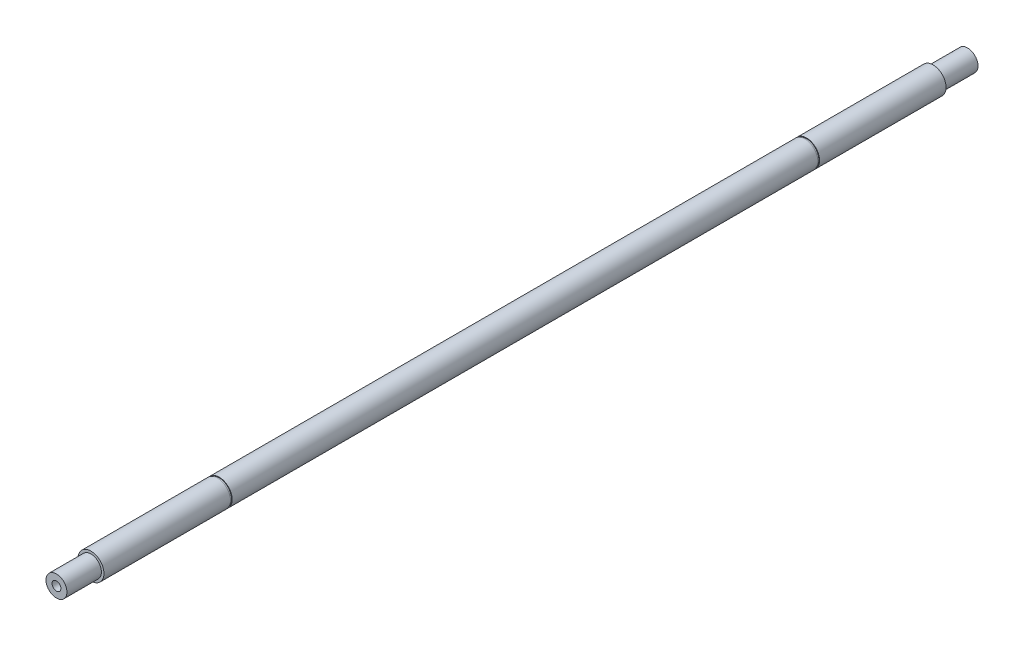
ISO-10303-21;
HEADER;
FILE_DESCRIPTION(('STEP AP214'),'2;1');
FILE_NAME('part.step','',(''),(''),'','','');
FILE_SCHEMA(('AUTOMOTIVE_DESIGN { 1 0 10303 214 1 1 1 1 }'));
ENDSEC;
DATA;
#1=APPLICATION_CONTEXT('core data for automotive mechanical design processes');
#2=APPLICATION_PROTOCOL_DEFINITION('international standard','automotive_design',2000,#1);
#3=PRODUCT_CONTEXT('',#1,'mechanical');
#4=PRODUCT('Part','Part','',(#3));
#5=PRODUCT_RELATED_PRODUCT_CATEGORY('part','',(#4));
#6=PRODUCT_DEFINITION_FORMATION('','',#4);
#7=PRODUCT_DEFINITION_CONTEXT('part definition',#1,'design');
#8=PRODUCT_DEFINITION('design','',#6,#7);
#9=PRODUCT_DEFINITION_SHAPE('','',#8);
#10=(LENGTH_UNIT() NAMED_UNIT(*) SI_UNIT(.MILLI.,.METRE.));
#11=(NAMED_UNIT(*) PLANE_ANGLE_UNIT() SI_UNIT($,.RADIAN.));
#12=(NAMED_UNIT(*) SI_UNIT($,.STERADIAN.) SOLID_ANGLE_UNIT());
#13=UNCERTAINTY_MEASURE_WITH_UNIT(LENGTH_MEASURE(1.E-05),#10,'distance_accuracy_value','');
#14=(GEOMETRIC_REPRESENTATION_CONTEXT(3) GLOBAL_UNCERTAINTY_ASSIGNED_CONTEXT((#13)) GLOBAL_UNIT_ASSIGNED_CONTEXT((#10,
#11,#12)) REPRESENTATION_CONTEXT('',''));
#15=CARTESIAN_POINT('',(0.,0.,0.));
#16=DIRECTION('',(0.,0.,1.));
#17=DIRECTION('',(1.,0.,0.));
#18=AXIS2_PLACEMENT_3D('',#15,#16,#17);
#19=CARTESIAN_POINT('',(0.,-1.11022302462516E-13,350.));
#20=DIRECTION('',(0.,0.,-1.));
#21=DIRECTION('',(-1.,0.,0.));
#22=AXIS2_PLACEMENT_3D('',#19,#20,#21);
#23=CYLINDRICAL_SURFACE('',#22,10.);
#24=CARTESIAN_POINT('',(0.,0.,225.));
#25=DIRECTION('',(0.,0.,1.));
#26=DIRECTION('',(1.,0.,0.));
#27=AXIS2_PLACEMENT_3D('',#24,#25,#26);
#28=CIRCLE('',#27,10.);
#29=CARTESIAN_POINT('',(10.,0.,225.));
#30=VERTEX_POINT('',#29);
#31=EDGE_CURVE('E103',#30,#30,#28,.T.);
#32=ORIENTED_EDGE('',*,*,#31,.F.);
#33=EDGE_LOOP('',(#32));
#34=FACE_BOUND('',#33,.T.);
#35=CARTESIAN_POINT('',(0.,-1.11022302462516E-13,-225.));
#36=DIRECTION('',(0.,0.,-1.));
#37=DIRECTION('',(-1.,0.,0.));
#38=AXIS2_PLACEMENT_3D('',#35,#36,#37);
#39=CIRCLE('',#38,10.);
#40=CARTESIAN_POINT('',(-10.,-1.09356967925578E-13,-225.));
#41=VERTEX_POINT('',#40);
#42=EDGE_CURVE('E48',#41,#41,#39,.T.);
#43=ORIENTED_EDGE('',*,*,#42,.F.);
#44=EDGE_LOOP('',(#43));
#45=FACE_BOUND('',#44,.T.);
#46=ADVANCED_FACE('F44',(#34,#45),#23,.T.);
#47=CARTESIAN_POINT('',(0.,0.,323.5));
#48=DIRECTION('',(0.,0.,1.));
#49=DIRECTION('',(1.,0.,0.));
#50=AXIS2_PLACEMENT_3D('',#47,#48,#49);
#51=CIRCLE('',#50,10.);
#52=CARTESIAN_POINT('',(10.,0.,323.5));
#53=VERTEX_POINT('',#52);
#54=EDGE_CURVE('E12',#53,#53,#51,.T.);
#55=ORIENTED_EDGE('',*,*,#54,.F.);
#56=EDGE_LOOP('',(#55));
#57=FACE_BOUND('',#56,.T.);
#58=CARTESIAN_POINT('',(0.,2.22044604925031E-13,226.3));
#59=DIRECTION('',(0.,0.,-1.));
#60=DIRECTION('',(-1.,0.,0.));
#61=AXIS2_PLACEMENT_3D('',#58,#59,#60);
#62=CIRCLE('',#61,10.);
#63=CARTESIAN_POINT('',(-10.,2.23709939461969E-13,226.3));
#64=VERTEX_POINT('',#63);
#65=EDGE_CURVE('E109',#64,#64,#62,.T.);
#66=ORIENTED_EDGE('',*,*,#65,.F.);
#67=EDGE_LOOP('',(#66));
#68=FACE_BOUND('',#67,.T.);
#69=ADVANCED_FACE('F46',(#57,#68),#23,.T.);
#70=CARTESIAN_POINT('',(0.,0.,323.5));
#71=DIRECTION('',(0.,0.,1.));
#72=DIRECTION('',(1.,0.,0.));
#73=AXIS2_PLACEMENT_3D('',#70,#71,#72);
#74=PLANE('',#73);
#75=CARTESIAN_POINT('',(0.,0.,323.5));
#76=DIRECTION('',(0.,0.,1.));
#77=DIRECTION('',(1.,0.,0.));
#78=AXIS2_PLACEMENT_3D('',#75,#76,#77);
#79=CIRCLE('',#78,8.05);
#80=CARTESIAN_POINT('',(8.05,0.,323.5));
#81=VERTEX_POINT('',#80);
#82=EDGE_CURVE('E54',#81,#81,#79,.T.);
#83=ORIENTED_EDGE('',*,*,#82,.F.);
#84=EDGE_LOOP('',(#83));
#85=FACE_BOUND('',#84,.T.);
#86=ORIENTED_EDGE('',*,*,#54,.T.);
#87=EDGE_LOOP('',(#86));
#88=FACE_BOUND('',#87,.T.);
#89=ADVANCED_FACE('F144',(#85,#88),#74,.T.);
#90=CARTESIAN_POINT('',(0.,0.,323.5));
#91=DIRECTION('',(0.,0.,1.));
#92=DIRECTION('',(1.,0.,0.));
#93=AXIS2_PLACEMENT_3D('',#90,#91,#92);
#94=CYLINDRICAL_SURFACE('',#93,8.05);
#95=ORIENTED_EDGE('',*,*,#82,.T.);
#96=EDGE_LOOP('',(#95));
#97=FACE_BOUND('',#96,.T.);
#98=CARTESIAN_POINT('',(0.,-1.11022302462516E-13,350.));
#99=DIRECTION('',(0.,0.,1.));
#100=DIRECTION('',(1.,0.,0.));
#101=AXIS2_PLACEMENT_3D('',#98,#99,#100);
#102=CIRCLE('',#101,8.05);
#103=CARTESIAN_POINT('',(8.05,-1.12362896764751E-13,350.));
#104=VERTEX_POINT('',#103);
#105=EDGE_CURVE('E114',#104,#104,#102,.T.);
#106=ORIENTED_EDGE('',*,*,#105,.F.);
#107=EDGE_LOOP('',(#106));
#108=FACE_BOUND('',#107,.T.);
#109=ADVANCED_FACE('F173',(#97,#108),#94,.T.);
#110=CARTESIAN_POINT('',(0.,-1.11022302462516E-13,350.));
#111=DIRECTION('',(0.,0.,1.));
#112=DIRECTION('',(1.,0.,0.));
#113=AXIS2_PLACEMENT_3D('',#110,#111,#112);
#114=PLANE('',#113);
#115=CARTESIAN_POINT('',(0.,-1.11022302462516E-13,350.));
#116=DIRECTION('',(0.,0.,1.));
#117=DIRECTION('',(1.,0.,0.));
#118=AXIS2_PLACEMENT_3D('',#115,#116,#117);
#119=CIRCLE('',#118,3.39999999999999);
#120=CARTESIAN_POINT('',(3.39999999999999,-1.11588516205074E-13,350.));
#121=VERTEX_POINT('',#120);
#122=EDGE_CURVE('E83',#121,#121,#119,.T.);
#123=ORIENTED_EDGE('',*,*,#122,.F.);
#124=EDGE_LOOP('',(#123));
#125=FACE_BOUND('',#124,.T.);
#126=ORIENTED_EDGE('',*,*,#105,.T.);
#127=EDGE_LOOP('',(#126));
#128=FACE_BOUND('',#127,.T.);
#129=ADVANCED_FACE('F176',(#125,#128),#114,.T.);
#130=CARTESIAN_POINT('',(0.,9.49999999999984,226.3));
#131=DIRECTION('',(0.,0.,-1.));
#132=DIRECTION('',(-1.,0.,0.));
#133=AXIS2_PLACEMENT_3D('',#130,#131,#132);
#134=PLANE('',#133);
#135=CARTESIAN_POINT('',(0.,2.22044604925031E-13,226.3));
#136=DIRECTION('',(0.,0.,-1.));
#137=DIRECTION('',(-1.,0.,0.));
#138=AXIS2_PLACEMENT_3D('',#135,#136,#137);
#139=CIRCLE('',#138,9.5);
#140=CARTESIAN_POINT('',(-9.50000000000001,2.23626672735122E-13,226.3));
#141=VERTEX_POINT('',#140);
#142=EDGE_CURVE('E99',#141,#141,#139,.T.);
#143=ORIENTED_EDGE('',*,*,#142,.F.);
#144=EDGE_LOOP('',(#143));
#145=FACE_BOUND('',#144,.T.);
#146=ORIENTED_EDGE('',*,*,#65,.T.);
#147=EDGE_LOOP('',(#146));
#148=FACE_BOUND('',#147,.T.);
#149=ADVANCED_FACE('F185',(#145,#148),#134,.T.);
#150=CARTESIAN_POINT('',(0.,12.,225.));
#151=DIRECTION('',(0.,0.,1.));
#152=DIRECTION('',(1.,0.,0.));
#153=AXIS2_PLACEMENT_3D('',#150,#151,#152);
#154=PLANE('',#153);
#155=CARTESIAN_POINT('',(0.,0.,225.));
#156=DIRECTION('',(0.,0.,-1.));
#157=DIRECTION('',(-1.,0.,0.));
#158=AXIS2_PLACEMENT_3D('',#155,#156,#157);
#159=CIRCLE('',#158,9.5);
#160=CARTESIAN_POINT('',(-9.50000000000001,0.,225.));
#161=VERTEX_POINT('',#160);
#162=EDGE_CURVE('E96',#161,#161,#159,.T.);
#163=ORIENTED_EDGE('',*,*,#162,.T.);
#164=EDGE_LOOP('',(#163));
#165=FACE_BOUND('',#164,.T.);
#166=ORIENTED_EDGE('',*,*,#31,.T.);
#167=EDGE_LOOP('',(#166));
#168=FACE_BOUND('',#167,.T.);
#169=ADVANCED_FACE('F190',(#165,#168),#154,.T.);
#170=CARTESIAN_POINT('',(0.,0.,400.));
#171=DIRECTION('',(0.,0.,-1.));
#172=DIRECTION('',(-1.,0.,0.));
#173=AXIS2_PLACEMENT_3D('',#170,#171,#172);
#174=CYLINDRICAL_SURFACE('',#173,9.5);
#175=ORIENTED_EDGE('',*,*,#142,.T.);
#176=EDGE_LOOP('',(#175));
#177=FACE_BOUND('',#176,.T.);
#178=ORIENTED_EDGE('',*,*,#162,.F.);
#179=EDGE_LOOP('',(#178));
#180=FACE_BOUND('',#179,.T.);
#181=ADVANCED_FACE('F201',(#177,#180),#174,.T.);
#182=CARTESIAN_POINT('',(4.44089209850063E-13,9.50000000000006,-225.));
#183=DIRECTION('',(0.,0.,-1.));
#184=DIRECTION('',(-1.,0.,0.));
#185=AXIS2_PLACEMENT_3D('',#182,#183,#184);
#186=PLANE('',#185);
#187=CARTESIAN_POINT('',(0.,-1.11022302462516E-13,-225.));
#188=DIRECTION('',(0.,0.,-1.));
#189=DIRECTION('',(-1.,0.,0.));
#190=AXIS2_PLACEMENT_3D('',#187,#188,#189);
#191=CIRCLE('',#190,9.5);
#192=CARTESIAN_POINT('',(-9.50000000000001,-1.09440234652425E-13,-225.));
#193=VERTEX_POINT('',#192);
#194=EDGE_CURVE('E91',#193,#193,#191,.T.);
#195=ORIENTED_EDGE('',*,*,#194,.F.);
#196=EDGE_LOOP('',(#195));
#197=FACE_BOUND('',#196,.T.);
#198=ORIENTED_EDGE('',*,*,#42,.T.);
#199=EDGE_LOOP('',(#198));
#200=FACE_BOUND('',#199,.T.);
#201=ADVANCED_FACE('F136',(#197,#200),#186,.T.);
#202=CARTESIAN_POINT('',(0.,12.,-226.3));
#203=DIRECTION('',(0.,0.,1.));
#204=DIRECTION('',(1.,0.,0.));
#205=AXIS2_PLACEMENT_3D('',#202,#203,#204);
#206=PLANE('',#205);
#207=CARTESIAN_POINT('',(4.44089209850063E-13,-2.22044604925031E-13,-226.3));
#208=DIRECTION('',(0.,0.,-1.));
#209=DIRECTION('',(-1.,0.,0.));
#210=AXIS2_PLACEMENT_3D('',#207,#208,#209);
#211=CIRCLE('',#210,9.5);
#212=CARTESIAN_POINT('',(-9.49999999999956,-2.2046253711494E-13,-226.3));
#213=VERTEX_POINT('',#212);
#214=EDGE_CURVE('E87',#213,#213,#211,.T.);
#215=ORIENTED_EDGE('',*,*,#214,.T.);
#216=EDGE_LOOP('',(#215));
#217=FACE_BOUND('',#216,.T.);
#218=CARTESIAN_POINT('',(0.,-1.11022302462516E-13,-226.3));
#219=DIRECTION('',(0.,0.,1.));
#220=DIRECTION('',(1.,0.,0.));
#221=AXIS2_PLACEMENT_3D('',#218,#219,#220);
#222=CIRCLE('',#221,10.);
#223=CARTESIAN_POINT('',(10.,-1.12687636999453E-13,-226.3));
#224=VERTEX_POINT('',#223);
#225=EDGE_CURVE('E95',#224,#224,#222,.T.);
#226=ORIENTED_EDGE('',*,*,#225,.T.);
#227=EDGE_LOOP('',(#226));
#228=FACE_BOUND('',#227,.T.);
#229=ADVANCED_FACE('F212',(#217,#228),#206,.T.);
#230=CARTESIAN_POINT('',(0.,0.,400.));
#231=DIRECTION('',(0.,0.,-1.));
#232=DIRECTION('',(-1.,0.,0.));
#233=AXIS2_PLACEMENT_3D('',#230,#231,#232);
#234=CYLINDRICAL_SURFACE('',#233,9.5);
#235=ORIENTED_EDGE('',*,*,#194,.T.);
#236=EDGE_LOOP('',(#235));
#237=FACE_BOUND('',#236,.T.);
#238=ORIENTED_EDGE('',*,*,#214,.F.);
#239=EDGE_LOOP('',(#238));
#240=FACE_BOUND('',#239,.T.);
#241=ADVANCED_FACE('F182',(#237,#240),#234,.T.);
#242=CARTESIAN_POINT('',(0.,2.22044604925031E-13,-350.));
#243=DIRECTION('',(0.,0.,1.));
#244=DIRECTION('',(1.,0.,0.));
#245=AXIS2_PLACEMENT_3D('',#242,#243,#244);
#246=PLANE('',#245);
#247=CARTESIAN_POINT('',(0.,2.22044604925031E-13,-350.));
#248=DIRECTION('',(0.,0.,-1.));
#249=DIRECTION('',(-1.,0.,0.));
#250=AXIS2_PLACEMENT_3D('',#247,#248,#249);
#251=CIRCLE('',#250,3.39999999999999);
#252=CARTESIAN_POINT('',(-3.39999999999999,2.2261081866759E-13,-350.));
#253=VERTEX_POINT('',#252);
#254=EDGE_CURVE('E71',#253,#253,#251,.T.);
#255=ORIENTED_EDGE('',*,*,#254,.F.);
#256=EDGE_LOOP('',(#255));
#257=FACE_BOUND('',#256,.T.);
#258=CARTESIAN_POINT('',(0.,2.22044604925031E-13,-350.));
#259=DIRECTION('',(0.,0.,-1.));
#260=DIRECTION('',(-1.,0.,0.));
#261=AXIS2_PLACEMENT_3D('',#258,#259,#260);
#262=CIRCLE('',#261,8.05);
#263=CARTESIAN_POINT('',(-8.05,2.23385199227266E-13,-350.));
#264=VERTEX_POINT('',#263);
#265=EDGE_CURVE('E104',#264,#264,#262,.T.);
#266=ORIENTED_EDGE('',*,*,#265,.T.);
#267=EDGE_LOOP('',(#266));
#268=FACE_BOUND('',#267,.T.);
#269=ADVANCED_FACE('F167',(#257,#268),#246,.F.);
#270=CARTESIAN_POINT('',(4.44089209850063E-13,-2.22044604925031E-13,-323.5));
#271=DIRECTION('',(0.,0.,-1.));
#272=DIRECTION('',(-1.,0.,0.));
#273=AXIS2_PLACEMENT_3D('',#270,#271,#272);
#274=CYLINDRICAL_SURFACE('',#273,8.05);
#275=CARTESIAN_POINT('',(4.44089209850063E-13,-2.22044604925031E-13,-323.5));
#276=DIRECTION('',(0.,0.,-1.));
#277=DIRECTION('',(-1.,0.,0.));
#278=AXIS2_PLACEMENT_3D('',#275,#276,#277);
#279=CIRCLE('',#278,8.05);
#280=CARTESIAN_POINT('',(-8.04999999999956,-2.20704010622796E-13,-323.5));
#281=VERTEX_POINT('',#280);
#282=EDGE_CURVE('E108',#281,#281,#279,.T.);
#283=ORIENTED_EDGE('',*,*,#282,.T.);
#284=EDGE_LOOP('',(#283));
#285=FACE_BOUND('',#284,.T.);
#286=ORIENTED_EDGE('',*,*,#265,.F.);
#287=EDGE_LOOP('',(#286));
#288=FACE_BOUND('',#287,.T.);
#289=ADVANCED_FACE('F158',(#285,#288),#274,.T.);
#290=CARTESIAN_POINT('',(4.44089209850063E-13,-2.22044604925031E-13,-323.5));
#291=DIRECTION('',(0.,0.,-1.));
#292=DIRECTION('',(-1.,0.,0.));
#293=AXIS2_PLACEMENT_3D('',#290,#291,#292);
#294=PLANE('',#293);
#295=ORIENTED_EDGE('',*,*,#282,.F.);
#296=EDGE_LOOP('',(#295));
#297=FACE_BOUND('',#296,.T.);
#298=CARTESIAN_POINT('',(4.44089209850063E-13,-1.11022302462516E-13,-323.5));
#299=DIRECTION('',(0.,0.,-1.));
#300=DIRECTION('',(-1.,0.,0.));
#301=AXIS2_PLACEMENT_3D('',#298,#299,#300);
#302=CIRCLE('',#301,10.);
#303=CARTESIAN_POINT('',(-9.99999999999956,-1.09356967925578E-13,-323.5));
#304=VERTEX_POINT('',#303);
#305=EDGE_CURVE('E113',#304,#304,#302,.T.);
#306=ORIENTED_EDGE('',*,*,#305,.T.);
#307=EDGE_LOOP('',(#306));
#308=FACE_BOUND('',#307,.T.);
#309=ADVANCED_FACE('F149',(#297,#308),#294,.T.);
#310=ORIENTED_EDGE('',*,*,#305,.F.);
#311=EDGE_LOOP('',(#310));
#312=FACE_BOUND('',#311,.T.);
#313=ORIENTED_EDGE('',*,*,#225,.F.);
#314=EDGE_LOOP('',(#313));
#315=FACE_BOUND('',#314,.T.);
#316=ADVANCED_FACE('F140',(#312,#315),#23,.T.);
#317=CARTESIAN_POINT('',(0.,-1.11022302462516E-13,350.));
#318=DIRECTION('',(0.,0.,1.));
#319=DIRECTION('',(1.,0.,0.));
#320=AXIS2_PLACEMENT_3D('',#317,#318,#319);
#321=CYLINDRICAL_SURFACE('',#320,3.39999999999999);
#322=CARTESIAN_POINT('',(0.,0.,330.));
#323=DIRECTION('',(0.,0.,1.));
#324=DIRECTION('',(1.,0.,0.));
#325=AXIS2_PLACEMENT_3D('',#322,#323,#324);
#326=CIRCLE('',#325,3.39999999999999);
#327=CARTESIAN_POINT('',(3.39999999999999,0.,330.));
#328=VERTEX_POINT('',#327);
#329=EDGE_CURVE('E77',#328,#328,#326,.T.);
#330=ORIENTED_EDGE('',*,*,#329,.F.);
#331=EDGE_LOOP('',(#330));
#332=FACE_BOUND('',#331,.T.);
#333=ORIENTED_EDGE('',*,*,#122,.T.);
#334=EDGE_LOOP('',(#333));
#335=FACE_BOUND('',#334,.T.);
#336=ADVANCED_FACE('F148',(#332,#335),#321,.F.);
#337=CARTESIAN_POINT('',(0.,0.,330.));
#338=DIRECTION('',(0.,0.,1.));
#339=DIRECTION('',(1.,0.,0.));
#340=AXIS2_PLACEMENT_3D('',#337,#338,#339);
#341=CONICAL_SURFACE('',#340,3.39999999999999,1.02974425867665);
#342=CARTESIAN_POINT('',(0.,-1.11022302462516E-13,327.957073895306));
#343=VERTEX_POINT('',#342);
#344=VERTEX_LOOP('',#343);
#345=FACE_BOUND('',#344,.T.);
#346=ORIENTED_EDGE('',*,*,#329,.T.);
#347=EDGE_LOOP('',(#346));
#348=FACE_BOUND('',#347,.T.);
#349=ADVANCED_FACE('F155',(#345,#348),#341,.F.);
#350=CARTESIAN_POINT('',(0.,2.22044604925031E-13,-350.));
#351=DIRECTION('',(0.,0.,-1.));
#352=DIRECTION('',(-1.,0.,0.));
#353=AXIS2_PLACEMENT_3D('',#350,#351,#352);
#354=CYLINDRICAL_SURFACE('',#353,3.39999999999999);
#355=CARTESIAN_POINT('',(0.,0.,-330.));
#356=DIRECTION('',(0.,0.,-1.));
#357=DIRECTION('',(-1.,0.,0.));
#358=AXIS2_PLACEMENT_3D('',#355,#356,#357);
#359=CIRCLE('',#358,3.39999999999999);
#360=CARTESIAN_POINT('',(-3.39999999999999,0.,-330.));
#361=VERTEX_POINT('',#360);
#362=EDGE_CURVE('E68',#361,#361,#359,.T.);
#363=ORIENTED_EDGE('',*,*,#362,.F.);
#364=EDGE_LOOP('',(#363));
#365=FACE_BOUND('',#364,.T.);
#366=ORIENTED_EDGE('',*,*,#254,.T.);
#367=EDGE_LOOP('',(#366));
#368=FACE_BOUND('',#367,.T.);
#369=ADVANCED_FACE('F64',(#365,#368),#354,.F.);
#370=CARTESIAN_POINT('',(0.,0.,-330.));
#371=DIRECTION('',(0.,0.,-1.));
#372=DIRECTION('',(-1.,0.,0.));
#373=AXIS2_PLACEMENT_3D('',#370,#371,#372);
#374=CONICAL_SURFACE('',#373,3.39999999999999,1.02974425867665);
#375=CARTESIAN_POINT('',(0.,0.,-327.957073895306));
#376=VERTEX_POINT('',#375);
#377=VERTEX_LOOP('',#376);
#378=FACE_BOUND('',#377,.T.);
#379=ORIENTED_EDGE('',*,*,#362,.T.);
#380=EDGE_LOOP('',(#379));
#381=FACE_BOUND('',#380,.T.);
#382=ADVANCED_FACE('F61',(#378,#381),#374,.F.);
#383=CLOSED_SHELL('',(#46,#69,#89,#109,#129,#149,#169,#181,#201,#229,#241,#269,#289,#309,#316,
#336,#349,#369,#382));
#384=MANIFOLD_SOLID_BREP('B2',#383);
#385=ADVANCED_BREP_SHAPE_REPRESENTATION('',(#18,#384),#14);
#386=SHAPE_DEFINITION_REPRESENTATION(#9,#385);
ENDSEC;
END-ISO-10303-21;
